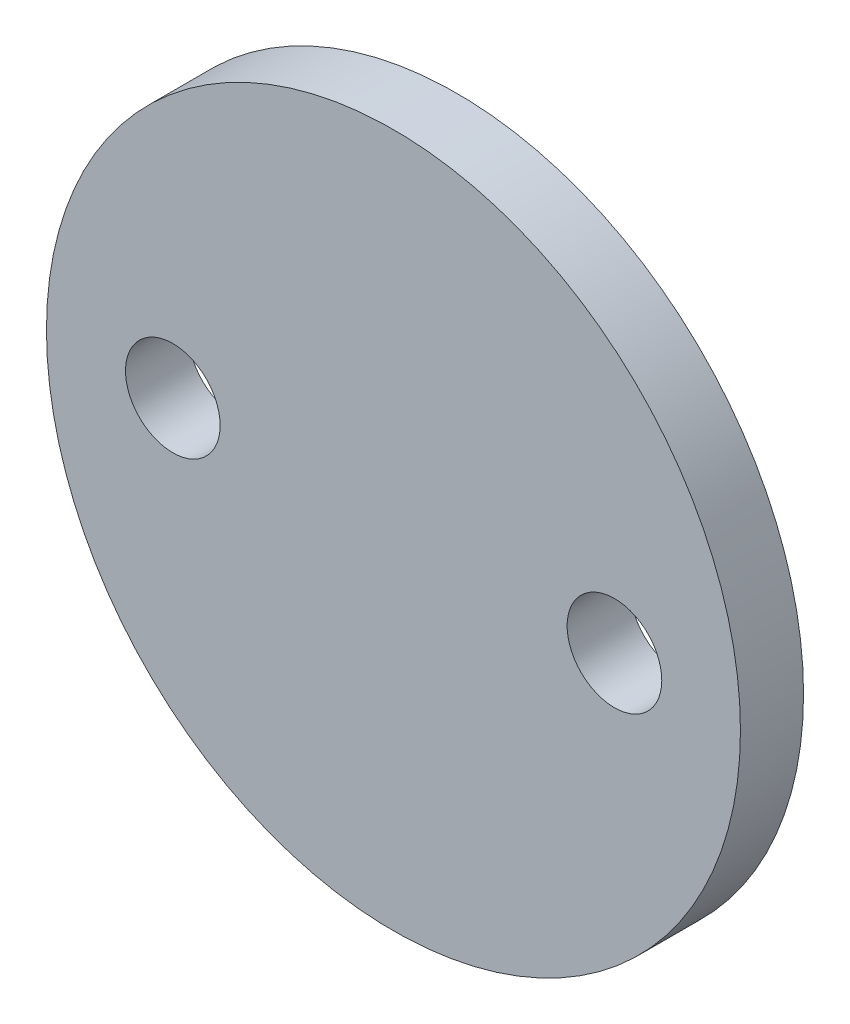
ISO-10303-21;
HEADER;
FILE_DESCRIPTION(('STEP AP214'),'2;1');
FILE_NAME('part.step','',(''),(''),'','','');
FILE_SCHEMA(('AUTOMOTIVE_DESIGN { 1 0 10303 214 1 1 1 1 }'));
ENDSEC;
DATA;
#1=APPLICATION_CONTEXT('core data for automotive mechanical design processes');
#2=APPLICATION_PROTOCOL_DEFINITION('international standard','automotive_design',2000,#1);
#3=PRODUCT_CONTEXT('',#1,'mechanical');
#4=PRODUCT('Part','Part','',(#3));
#5=PRODUCT_RELATED_PRODUCT_CATEGORY('part','',(#4));
#6=PRODUCT_DEFINITION_FORMATION('','',#4);
#7=PRODUCT_DEFINITION_CONTEXT('part definition',#1,'design');
#8=PRODUCT_DEFINITION('design','',#6,#7);
#9=PRODUCT_DEFINITION_SHAPE('','',#8);
#10=(LENGTH_UNIT() NAMED_UNIT(*) SI_UNIT(.MILLI.,.METRE.));
#11=(NAMED_UNIT(*) PLANE_ANGLE_UNIT() SI_UNIT($,.RADIAN.));
#12=(NAMED_UNIT(*) SI_UNIT($,.STERADIAN.) SOLID_ANGLE_UNIT());
#13=UNCERTAINTY_MEASURE_WITH_UNIT(LENGTH_MEASURE(1.E-05),#10,'distance_accuracy_value','');
#14=(GEOMETRIC_REPRESENTATION_CONTEXT(3) GLOBAL_UNCERTAINTY_ASSIGNED_CONTEXT((#13)) GLOBAL_UNIT_ASSIGNED_CONTEXT((#10,
#11,#12)) REPRESENTATION_CONTEXT('',''));
#15=CARTESIAN_POINT('',(0.,0.,0.));
#16=DIRECTION('',(0.,0.,1.));
#17=DIRECTION('',(1.,0.,0.));
#18=AXIS2_PLACEMENT_3D('',#15,#16,#17);
#19=CARTESIAN_POINT('',(-33.064546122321,14.1642911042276,10.9997000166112));
#20=DIRECTION('',(0.,0.,-1.));
#21=DIRECTION('',(-1.,0.,0.));
#22=AXIS2_PLACEMENT_3D('',#19,#20,#21);
#23=CYLINDRICAL_SURFACE('',#22,17.4625);
#24=CARTESIAN_POINT('',(-33.064546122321,14.1642911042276,10.9997000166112));
#25=DIRECTION('',(0.,0.,1.));
#26=DIRECTION('',(1.,0.,0.));
#27=AXIS2_PLACEMENT_3D('',#24,#25,#26);
#28=CIRCLE('',#27,17.4625);
#29=CARTESIAN_POINT('',(-15.602046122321,14.1642911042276,10.9997000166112));
#30=VERTEX_POINT('',#29);
#31=EDGE_CURVE('E10',#30,#30,#28,.T.);
#32=ORIENTED_EDGE('',*,*,#31,.F.);
#33=EDGE_LOOP('',(#32));
#34=FACE_BOUND('',#33,.T.);
#35=CARTESIAN_POINT('',(-33.064546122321,14.1642911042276,7.82470001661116));
#36=DIRECTION('',(0.,0.,1.));
#37=DIRECTION('',(1.,0.,0.));
#38=AXIS2_PLACEMENT_3D('',#35,#36,#37);
#39=CIRCLE('',#38,17.4625);
#40=CARTESIAN_POINT('',(-15.602046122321,14.1642911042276,7.82470001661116));
#41=VERTEX_POINT('',#40);
#42=EDGE_CURVE('E35',#41,#41,#39,.T.);
#43=ORIENTED_EDGE('',*,*,#42,.T.);
#44=EDGE_LOOP('',(#43));
#45=FACE_BOUND('',#44,.T.);
#46=ADVANCED_FACE('F29',(#34,#45),#23,.T.);
#47=CARTESIAN_POINT('',(-33.064546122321,14.1642911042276,10.9997000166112));
#48=DIRECTION('',(0.,0.,1.));
#49=DIRECTION('',(1.,0.,0.));
#50=AXIS2_PLACEMENT_3D('',#47,#48,#49);
#51=PLANE('',#50);
#52=ORIENTED_EDGE('',*,*,#31,.T.);
#53=EDGE_LOOP('',(#52));
#54=FACE_BOUND('',#53,.T.);
#55=CARTESIAN_POINT('',(-21.9427885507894,14.3693667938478,10.9997000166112));
#56=DIRECTION('',(0.,0.,1.));
#57=DIRECTION('',(1.,0.,0.));
#58=AXIS2_PLACEMENT_3D('',#55,#56,#57);
#59=CIRCLE('',#58,2.38125);
#60=CARTESIAN_POINT('',(-19.5615385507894,14.3693667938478,10.9997000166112));
#61=VERTEX_POINT('',#60);
#62=EDGE_CURVE('E43',#61,#61,#59,.T.);
#63=ORIENTED_EDGE('',*,*,#62,.F.);
#64=EDGE_LOOP('',(#63));
#65=FACE_BOUND('',#64,.T.);
#66=CARTESIAN_POINT('',(-44.1677885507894,14.3693667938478,10.9997000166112));
#67=DIRECTION('',(0.,0.,1.));
#68=DIRECTION('',(1.,0.,0.));
#69=AXIS2_PLACEMENT_3D('',#66,#67,#68);
#70=CIRCLE('',#69,2.38125);
#71=CARTESIAN_POINT('',(-41.7865385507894,14.3693667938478,10.9997000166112));
#72=VERTEX_POINT('',#71);
#73=EDGE_CURVE('E51',#72,#72,#70,.T.);
#74=ORIENTED_EDGE('',*,*,#73,.F.);
#75=EDGE_LOOP('',(#74));
#76=FACE_BOUND('',#75,.T.);
#77=ADVANCED_FACE('F57',(#54,#65,#76),#51,.T.);
#78=CARTESIAN_POINT('',(-33.064546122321,14.1642911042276,7.82470001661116));
#79=DIRECTION('',(0.,0.,1.));
#80=DIRECTION('',(1.,0.,0.));
#81=AXIS2_PLACEMENT_3D('',#78,#79,#80);
#82=PLANE('',#81);
#83=ORIENTED_EDGE('',*,*,#42,.F.);
#84=EDGE_LOOP('',(#83));
#85=FACE_BOUND('',#84,.T.);
#86=CARTESIAN_POINT('',(-21.9427885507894,14.3693667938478,7.82470001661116));
#87=DIRECTION('',(0.,0.,1.));
#88=DIRECTION('',(1.,0.,0.));
#89=AXIS2_PLACEMENT_3D('',#86,#87,#88);
#90=CIRCLE('',#89,2.38125);
#91=CARTESIAN_POINT('',(-19.5615385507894,14.3693667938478,7.82470001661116));
#92=VERTEX_POINT('',#91);
#93=EDGE_CURVE('E39',#92,#92,#90,.F.);
#94=ORIENTED_EDGE('',*,*,#93,.F.);
#95=EDGE_LOOP('',(#94));
#96=FACE_BOUND('',#95,.T.);
#97=CARTESIAN_POINT('',(-44.1677885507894,14.3693667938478,7.82470001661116));
#98=DIRECTION('',(0.,0.,1.));
#99=DIRECTION('',(1.,0.,0.));
#100=AXIS2_PLACEMENT_3D('',#97,#98,#99);
#101=CIRCLE('',#100,2.38125);
#102=CARTESIAN_POINT('',(-41.7865385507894,14.3693667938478,7.82470001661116));
#103=VERTEX_POINT('',#102);
#104=EDGE_CURVE('E48',#103,#103,#101,.F.);
#105=ORIENTED_EDGE('',*,*,#104,.F.);
#106=EDGE_LOOP('',(#105));
#107=FACE_BOUND('',#106,.T.);
#108=ADVANCED_FACE('F59',(#85,#96,#107),#82,.F.);
#109=CARTESIAN_POINT('',(-21.9427885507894,14.3693667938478,0.909902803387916));
#110=DIRECTION('',(0.,0.,1.));
#111=DIRECTION('',(1.,0.,0.));
#112=AXIS2_PLACEMENT_3D('',#109,#110,#111);
#113=CYLINDRICAL_SURFACE('',#112,2.38125);
#114=ORIENTED_EDGE('',*,*,#93,.T.);
#115=EDGE_LOOP('',(#114));
#116=FACE_BOUND('',#115,.T.);
#117=ORIENTED_EDGE('',*,*,#62,.T.);
#118=EDGE_LOOP('',(#117));
#119=FACE_BOUND('',#118,.T.);
#120=ADVANCED_FACE('F64',(#116,#119),#113,.F.);
#121=CARTESIAN_POINT('',(-44.1677885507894,14.3693667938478,0.909902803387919));
#122=DIRECTION('',(0.,0.,1.));
#123=DIRECTION('',(1.,0.,0.));
#124=AXIS2_PLACEMENT_3D('',#121,#122,#123);
#125=CYLINDRICAL_SURFACE('',#124,2.38125);
#126=ORIENTED_EDGE('',*,*,#104,.T.);
#127=EDGE_LOOP('',(#126));
#128=FACE_BOUND('',#127,.T.);
#129=ORIENTED_EDGE('',*,*,#73,.T.);
#130=EDGE_LOOP('',(#129));
#131=FACE_BOUND('',#130,.T.);
#132=ADVANCED_FACE('F55',(#128,#131),#125,.F.);
#133=CLOSED_SHELL('',(#46,#77,#108,#120,#132));
#134=MANIFOLD_SOLID_BREP('B2',#133);
#135=ADVANCED_BREP_SHAPE_REPRESENTATION('',(#18,#134),#14);
#136=SHAPE_DEFINITION_REPRESENTATION(#9,#135);
ENDSEC;
END-ISO-10303-21;
